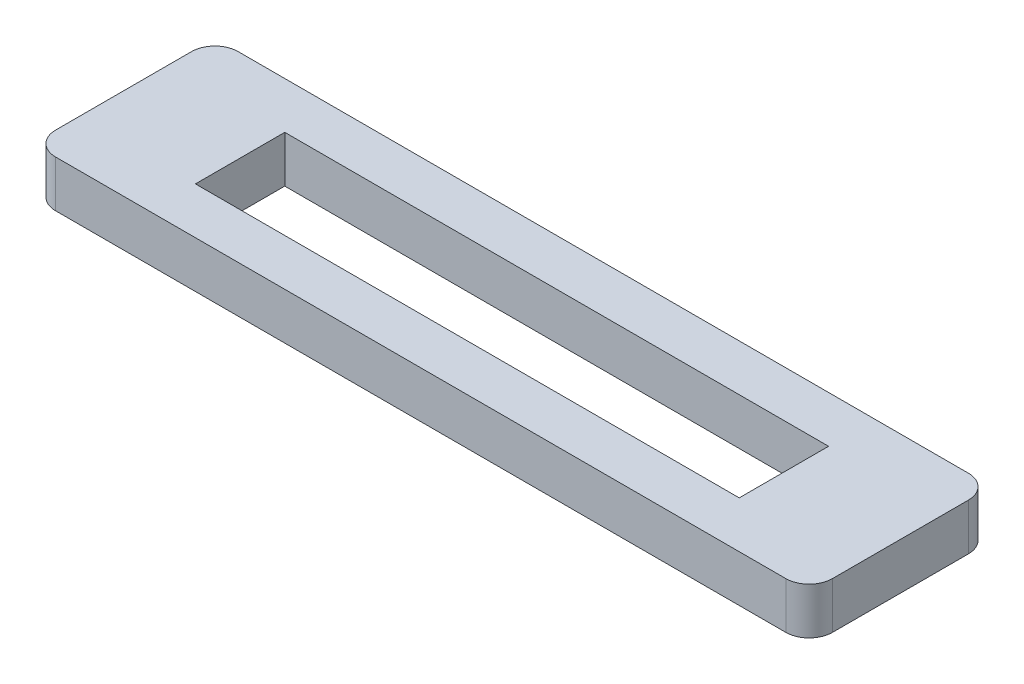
ISO-10303-21;
HEADER;
FILE_DESCRIPTION(('STEP AP214'),'2;1');
FILE_NAME('part.step','',(''),(''),'','','');
FILE_SCHEMA(('AUTOMOTIVE_DESIGN { 1 0 10303 214 1 1 1 1 }'));
ENDSEC;
DATA;
#1=APPLICATION_CONTEXT('core data for automotive mechanical design processes');
#2=APPLICATION_PROTOCOL_DEFINITION('international standard','automotive_design',2000,#1);
#3=PRODUCT_CONTEXT('',#1,'mechanical');
#4=PRODUCT('Part','Part','',(#3));
#5=PRODUCT_RELATED_PRODUCT_CATEGORY('part','',(#4));
#6=PRODUCT_DEFINITION_FORMATION('','',#4);
#7=PRODUCT_DEFINITION_CONTEXT('part definition',#1,'design');
#8=PRODUCT_DEFINITION('design','',#6,#7);
#9=PRODUCT_DEFINITION_SHAPE('','',#8);
#10=(LENGTH_UNIT() NAMED_UNIT(*) SI_UNIT(.MILLI.,.METRE.));
#11=(NAMED_UNIT(*) PLANE_ANGLE_UNIT() SI_UNIT($,.RADIAN.));
#12=(NAMED_UNIT(*) SI_UNIT($,.STERADIAN.) SOLID_ANGLE_UNIT());
#13=UNCERTAINTY_MEASURE_WITH_UNIT(LENGTH_MEASURE(1.E-05),#10,'distance_accuracy_value','');
#14=(GEOMETRIC_REPRESENTATION_CONTEXT(3) GLOBAL_UNCERTAINTY_ASSIGNED_CONTEXT((#13)) GLOBAL_UNIT_ASSIGNED_CONTEXT((#10,
#11,#12)) REPRESENTATION_CONTEXT('',''));
#15=CARTESIAN_POINT('',(0.,0.,0.));
#16=DIRECTION('',(0.,0.,1.));
#17=DIRECTION('',(1.,0.,0.));
#18=AXIS2_PLACEMENT_3D('',#15,#16,#17);
#19=CARTESIAN_POINT('',(0.,6.,0.));
#20=DIRECTION('',(0.,1.,0.));
#21=DIRECTION('',(0.,0.,1.));
#22=AXIS2_PLACEMENT_3D('',#19,#20,#21);
#23=PLANE('',#22);
#24=DIRECTION('',(0.,0.,-1.));
#25=VECTOR('',#24,1.);
#26=CARTESIAN_POINT('',(50.,6.,-11.75));
#27=LINE('',#26,#25);
#28=CARTESIAN_POINT('',(50.,6.,8.75));
#29=VERTEX_POINT('',#28);
#30=CARTESIAN_POINT('',(50.,6.,-8.75));
#31=VERTEX_POINT('',#30);
#32=EDGE_CURVE('E189',#29,#31,#27,.T.);
#33=ORIENTED_EDGE('',*,*,#32,.T.);
#34=CARTESIAN_POINT('',(47.,6.,-8.75));
#35=DIRECTION('',(0.,1.,0.));
#36=DIRECTION('',(0.,0.,1.));
#37=AXIS2_PLACEMENT_3D('',#34,#35,#36);
#38=CIRCLE('',#37,3.);
#39=CARTESIAN_POINT('',(47.,6.,-11.75));
#40=VERTEX_POINT('',#39);
#41=EDGE_CURVE('E251',#31,#40,#38,.T.);
#42=ORIENTED_EDGE('',*,*,#41,.T.);
#43=DIRECTION('',(-1.,0.,0.));
#44=VECTOR('',#43,1.);
#45=CARTESIAN_POINT('',(-50.,6.,-11.75));
#46=LINE('',#45,#44);
#47=CARTESIAN_POINT('',(-47.,6.,-11.75));
#48=VERTEX_POINT('',#47);
#49=EDGE_CURVE('E193',#40,#48,#46,.T.);
#50=ORIENTED_EDGE('',*,*,#49,.T.);
#51=CARTESIAN_POINT('',(-47.,6.,-8.75));
#52=DIRECTION('',(0.,1.,0.));
#53=DIRECTION('',(0.,0.,1.));
#54=AXIS2_PLACEMENT_3D('',#51,#52,#53);
#55=CIRCLE('',#54,3.);
#56=CARTESIAN_POINT('',(-50.,6.,-8.75));
#57=VERTEX_POINT('',#56);
#58=EDGE_CURVE('E245',#48,#57,#55,.T.);
#59=ORIENTED_EDGE('',*,*,#58,.T.);
#60=DIRECTION('',(0.,0.,1.));
#61=VECTOR('',#60,1.);
#62=CARTESIAN_POINT('',(-50.,6.,-11.75));
#63=LINE('',#62,#61);
#64=CARTESIAN_POINT('',(-50.,6.,8.75));
#65=VERTEX_POINT('',#64);
#66=EDGE_CURVE('E198',#57,#65,#63,.T.);
#67=ORIENTED_EDGE('',*,*,#66,.T.);
#68=CARTESIAN_POINT('',(-47.,6.,8.75));
#69=DIRECTION('',(0.,1.,0.));
#70=DIRECTION('',(0.,0.,1.));
#71=AXIS2_PLACEMENT_3D('',#68,#69,#70);
#72=CIRCLE('',#71,3.);
#73=CARTESIAN_POINT('',(-47.,6.,11.75));
#74=VERTEX_POINT('',#73);
#75=EDGE_CURVE('E66',#65,#74,#72,.T.);
#76=ORIENTED_EDGE('',*,*,#75,.T.);
#77=DIRECTION('',(1.,0.,0.));
#78=VECTOR('',#77,1.);
#79=CARTESIAN_POINT('',(-50.,6.,11.75));
#80=LINE('',#79,#78);
#81=CARTESIAN_POINT('',(47.,6.,11.75));
#82=VERTEX_POINT('',#81);
#83=EDGE_CURVE('E201',#74,#82,#80,.T.);
#84=ORIENTED_EDGE('',*,*,#83,.T.);
#85=CARTESIAN_POINT('',(47.,6.,8.75));
#86=DIRECTION('',(0.,1.,0.));
#87=DIRECTION('',(0.,0.,1.));
#88=AXIS2_PLACEMENT_3D('',#85,#86,#87);
#89=CIRCLE('',#88,3.);
#90=EDGE_CURVE('E248',#82,#29,#89,.T.);
#91=ORIENTED_EDGE('',*,*,#90,.T.);
#92=EDGE_LOOP('',(#33,#42,#50,#59,#67,#76,#84,#91));
#93=FACE_BOUND('',#92,.T.);
#94=DIRECTION('',(-1.,0.,0.));
#95=VECTOR('',#94,1.);
#96=CARTESIAN_POINT('',(-35.,6.,-5.75));
#97=LINE('',#96,#95);
#98=CARTESIAN_POINT('',(35.,6.,-5.75));
#99=VERTEX_POINT('',#98);
#100=CARTESIAN_POINT('',(-35.,6.,-5.75));
#101=VERTEX_POINT('',#100);
#102=EDGE_CURVE('E147',#99,#101,#97,.T.);
#103=ORIENTED_EDGE('',*,*,#102,.F.);
#104=DIRECTION('',(0.,0.,-1.));
#105=VECTOR('',#104,1.);
#106=CARTESIAN_POINT('',(35.,6.,-5.75));
#107=LINE('',#106,#105);
#108=CARTESIAN_POINT('',(35.,6.,5.75));
#109=VERTEX_POINT('',#108);
#110=EDGE_CURVE('E136',#109,#99,#107,.T.);
#111=ORIENTED_EDGE('',*,*,#110,.F.);
#112=DIRECTION('',(1.,0.,0.));
#113=VECTOR('',#112,1.);
#114=CARTESIAN_POINT('',(-35.,6.,5.75));
#115=LINE('',#114,#113);
#116=CARTESIAN_POINT('',(-35.,6.,5.75));
#117=VERTEX_POINT('',#116);
#118=EDGE_CURVE('E165',#117,#109,#115,.T.);
#119=ORIENTED_EDGE('',*,*,#118,.F.);
#120=DIRECTION('',(0.,0.,1.));
#121=VECTOR('',#120,1.);
#122=CARTESIAN_POINT('',(-35.,6.,-5.75));
#123=LINE('',#122,#121);
#124=EDGE_CURVE('E161',#101,#117,#123,.T.);
#125=ORIENTED_EDGE('',*,*,#124,.F.);
#126=EDGE_LOOP('',(#103,#111,#119,#125));
#127=FACE_BOUND('',#126,.T.);
#128=ADVANCED_FACE('F43',(#93,#127),#23,.T.);
#129=CARTESIAN_POINT('',(0.,0.,0.));
#130=DIRECTION('',(0.,1.,0.));
#131=DIRECTION('',(0.,0.,1.));
#132=AXIS2_PLACEMENT_3D('',#129,#130,#131);
#133=PLANE('',#132);
#134=DIRECTION('',(-1.,0.,0.));
#135=VECTOR('',#134,1.);
#136=CARTESIAN_POINT('',(-50.,0.,-11.75));
#137=LINE('',#136,#135);
#138=CARTESIAN_POINT('',(47.,0.,-11.75));
#139=VERTEX_POINT('',#138);
#140=CARTESIAN_POINT('',(-47.,0.,-11.75));
#141=VERTEX_POINT('',#140);
#142=EDGE_CURVE('E208',#139,#141,#137,.T.);
#143=ORIENTED_EDGE('',*,*,#142,.F.);
#144=CARTESIAN_POINT('',(47.,0.,-8.75));
#145=DIRECTION('',(0.,1.,0.));
#146=DIRECTION('',(0.,0.,1.));
#147=AXIS2_PLACEMENT_3D('',#144,#145,#146);
#148=CIRCLE('',#147,3.);
#149=CARTESIAN_POINT('',(50.,0.,-8.75));
#150=VERTEX_POINT('',#149);
#151=EDGE_CURVE('E233',#139,#150,#148,.F.);
#152=ORIENTED_EDGE('',*,*,#151,.T.);
#153=DIRECTION('',(0.,0.,-1.));
#154=VECTOR('',#153,1.);
#155=CARTESIAN_POINT('',(50.,0.,-11.75));
#156=LINE('',#155,#154);
#157=CARTESIAN_POINT('',(50.,0.,8.75));
#158=VERTEX_POINT('',#157);
#159=EDGE_CURVE('E156',#158,#150,#156,.T.);
#160=ORIENTED_EDGE('',*,*,#159,.F.);
#161=CARTESIAN_POINT('',(47.,0.,8.75));
#162=DIRECTION('',(0.,1.,0.));
#163=DIRECTION('',(0.,0.,1.));
#164=AXIS2_PLACEMENT_3D('',#161,#162,#163);
#165=CIRCLE('',#164,3.);
#166=CARTESIAN_POINT('',(47.,0.,11.75));
#167=VERTEX_POINT('',#166);
#168=EDGE_CURVE('E230',#158,#167,#165,.F.);
#169=ORIENTED_EDGE('',*,*,#168,.T.);
#170=DIRECTION('',(1.,0.,0.));
#171=VECTOR('',#170,1.);
#172=CARTESIAN_POINT('',(-50.,0.,11.75));
#173=LINE('',#172,#171);
#174=CARTESIAN_POINT('',(-47.,0.,11.75));
#175=VERTEX_POINT('',#174);
#176=EDGE_CURVE('E194',#175,#167,#173,.T.);
#177=ORIENTED_EDGE('',*,*,#176,.F.);
#178=CARTESIAN_POINT('',(-47.,0.,8.75));
#179=DIRECTION('',(0.,1.,0.));
#180=DIRECTION('',(0.,0.,1.));
#181=AXIS2_PLACEMENT_3D('',#178,#179,#180);
#182=CIRCLE('',#181,3.);
#183=CARTESIAN_POINT('',(-50.,0.,8.75));
#184=VERTEX_POINT('',#183);
#185=EDGE_CURVE('E224',#175,#184,#182,.F.);
#186=ORIENTED_EDGE('',*,*,#185,.T.);
#187=DIRECTION('',(0.,0.,1.));
#188=VECTOR('',#187,1.);
#189=CARTESIAN_POINT('',(-50.,0.,-11.75));
#190=LINE('',#189,#188);
#191=CARTESIAN_POINT('',(-50.,0.,-8.75));
#192=VERTEX_POINT('',#191);
#193=EDGE_CURVE('E212',#192,#184,#190,.T.);
#194=ORIENTED_EDGE('',*,*,#193,.F.);
#195=CARTESIAN_POINT('',(-47.,0.,-8.75));
#196=DIRECTION('',(0.,1.,0.));
#197=DIRECTION('',(0.,0.,1.));
#198=AXIS2_PLACEMENT_3D('',#195,#196,#197);
#199=CIRCLE('',#198,3.);
#200=EDGE_CURVE('E227',#192,#141,#199,.F.);
#201=ORIENTED_EDGE('',*,*,#200,.T.);
#202=EDGE_LOOP('',(#143,#152,#160,#169,#177,#186,#194,#201));
#203=FACE_BOUND('',#202,.T.);
#204=DIRECTION('',(0.,0.,-1.));
#205=VECTOR('',#204,1.);
#206=CARTESIAN_POINT('',(35.,0.,-5.75));
#207=LINE('',#206,#205);
#208=CARTESIAN_POINT('',(35.,0.,5.75));
#209=VERTEX_POINT('',#208);
#210=CARTESIAN_POINT('',(35.,0.,-5.75));
#211=VERTEX_POINT('',#210);
#212=EDGE_CURVE('E170',#209,#211,#207,.T.);
#213=ORIENTED_EDGE('',*,*,#212,.T.);
#214=DIRECTION('',(-1.,0.,0.));
#215=VECTOR('',#214,1.);
#216=CARTESIAN_POINT('',(-35.,0.,-5.75));
#217=LINE('',#216,#215);
#218=CARTESIAN_POINT('',(-35.,0.,-5.75));
#219=VERTEX_POINT('',#218);
#220=EDGE_CURVE('E154',#211,#219,#217,.T.);
#221=ORIENTED_EDGE('',*,*,#220,.T.);
#222=DIRECTION('',(0.,0.,1.));
#223=VECTOR('',#222,1.);
#224=CARTESIAN_POINT('',(-35.,0.,-5.75));
#225=LINE('',#224,#223);
#226=CARTESIAN_POINT('',(-35.,0.,5.75));
#227=VERTEX_POINT('',#226);
#228=EDGE_CURVE('E175',#219,#227,#225,.T.);
#229=ORIENTED_EDGE('',*,*,#228,.T.);
#230=DIRECTION('',(1.,0.,0.));
#231=VECTOR('',#230,1.);
#232=CARTESIAN_POINT('',(-35.,0.,5.75));
#233=LINE('',#232,#231);
#234=EDGE_CURVE('E148',#227,#209,#233,.T.);
#235=ORIENTED_EDGE('',*,*,#234,.T.);
#236=EDGE_LOOP('',(#213,#221,#229,#235));
#237=FACE_BOUND('',#236,.T.);
#238=ADVANCED_FACE('F273',(#203,#237),#133,.F.);
#239=CARTESIAN_POINT('',(50.,6.,-11.75));
#240=DIRECTION('',(-1.,0.,0.));
#241=DIRECTION('',(0.,0.,1.));
#242=AXIS2_PLACEMENT_3D('',#239,#240,#241);
#243=PLANE('',#242);
#244=ORIENTED_EDGE('',*,*,#159,.T.);
#245=DIRECTION('',(0.,-1.,0.));
#246=VECTOR('',#245,1.);
#247=CARTESIAN_POINT('',(50.,6.,-8.75));
#248=LINE('',#247,#246);
#249=EDGE_CURVE('E240',#150,#31,#248,.F.);
#250=ORIENTED_EDGE('',*,*,#249,.T.);
#251=ORIENTED_EDGE('',*,*,#32,.F.);
#252=DIRECTION('',(0.,-1.,0.));
#253=VECTOR('',#252,1.);
#254=CARTESIAN_POINT('',(50.,6.,8.75));
#255=LINE('',#254,#253);
#256=EDGE_CURVE('E236',#29,#158,#255,.T.);
#257=ORIENTED_EDGE('',*,*,#256,.T.);
#258=EDGE_LOOP('',(#244,#250,#251,#257));
#259=FACE_BOUND('',#258,.T.);
#260=ADVANCED_FACE('F282',(#259),#243,.F.);
#261=CARTESIAN_POINT('',(-50.,6.,-11.75));
#262=DIRECTION('',(0.,0.,1.));
#263=DIRECTION('',(1.,0.,0.));
#264=AXIS2_PLACEMENT_3D('',#261,#262,#263);
#265=PLANE('',#264);
#266=ORIENTED_EDGE('',*,*,#49,.F.);
#267=DIRECTION('',(0.,-1.,0.));
#268=VECTOR('',#267,1.);
#269=CARTESIAN_POINT('',(47.,6.,-11.75));
#270=LINE('',#269,#268);
#271=EDGE_CURVE('E220',#40,#139,#270,.T.);
#272=ORIENTED_EDGE('',*,*,#271,.T.);
#273=ORIENTED_EDGE('',*,*,#142,.T.);
#274=DIRECTION('',(0.,-1.,0.));
#275=VECTOR('',#274,1.);
#276=CARTESIAN_POINT('',(-47.,6.,-11.75));
#277=LINE('',#276,#275);
#278=EDGE_CURVE('E204',#141,#48,#277,.F.);
#279=ORIENTED_EDGE('',*,*,#278,.T.);
#280=EDGE_LOOP('',(#266,#272,#273,#279));
#281=FACE_BOUND('',#280,.T.);
#282=ADVANCED_FACE('F290',(#281),#265,.F.);
#283=CARTESIAN_POINT('',(-50.,6.,-11.75));
#284=DIRECTION('',(1.,0.,0.));
#285=DIRECTION('',(0.,0.,-1.));
#286=AXIS2_PLACEMENT_3D('',#283,#284,#285);
#287=PLANE('',#286);
#288=ORIENTED_EDGE('',*,*,#66,.F.);
#289=DIRECTION('',(0.,-1.,0.));
#290=VECTOR('',#289,1.);
#291=CARTESIAN_POINT('',(-50.,6.,-8.75));
#292=LINE('',#291,#290);
#293=EDGE_CURVE('E11',#57,#192,#292,.T.);
#294=ORIENTED_EDGE('',*,*,#293,.T.);
#295=ORIENTED_EDGE('',*,*,#193,.T.);
#296=DIRECTION('',(0.,-1.,0.));
#297=VECTOR('',#296,1.);
#298=CARTESIAN_POINT('',(-50.,6.,8.75));
#299=LINE('',#298,#297);
#300=EDGE_CURVE('E52',#184,#65,#299,.F.);
#301=ORIENTED_EDGE('',*,*,#300,.T.);
#302=EDGE_LOOP('',(#288,#294,#295,#301));
#303=FACE_BOUND('',#302,.T.);
#304=ADVANCED_FACE('F263',(#303),#287,.F.);
#305=CARTESIAN_POINT('',(-50.,6.,11.75));
#306=DIRECTION('',(0.,0.,-1.));
#307=DIRECTION('',(-1.,0.,0.));
#308=AXIS2_PLACEMENT_3D('',#305,#306,#307);
#309=PLANE('',#308);
#310=ORIENTED_EDGE('',*,*,#176,.T.);
#311=DIRECTION('',(0.,-1.,0.));
#312=VECTOR('',#311,1.);
#313=CARTESIAN_POINT('',(47.,6.,11.75));
#314=LINE('',#313,#312);
#315=EDGE_CURVE('E59',#167,#82,#314,.F.);
#316=ORIENTED_EDGE('',*,*,#315,.T.);
#317=ORIENTED_EDGE('',*,*,#83,.F.);
#318=DIRECTION('',(0.,-1.,0.));
#319=VECTOR('',#318,1.);
#320=CARTESIAN_POINT('',(-47.,6.,11.75));
#321=LINE('',#320,#319);
#322=EDGE_CURVE('E254',#74,#175,#321,.T.);
#323=ORIENTED_EDGE('',*,*,#322,.T.);
#324=EDGE_LOOP('',(#310,#316,#317,#323));
#325=FACE_BOUND('',#324,.T.);
#326=ADVANCED_FACE('F270',(#325),#309,.F.);
#327=CARTESIAN_POINT('',(35.,6.,-5.75));
#328=DIRECTION('',(-1.,0.,0.));
#329=DIRECTION('',(0.,0.,1.));
#330=AXIS2_PLACEMENT_3D('',#327,#328,#329);
#331=PLANE('',#330);
#332=ORIENTED_EDGE('',*,*,#212,.F.);
#333=DIRECTION('',(0.,-1.,0.));
#334=VECTOR('',#333,1.);
#335=CARTESIAN_POINT('',(35.,6.,5.75));
#336=LINE('',#335,#334);
#337=EDGE_CURVE('E142',#109,#209,#336,.T.);
#338=ORIENTED_EDGE('',*,*,#337,.F.);
#339=ORIENTED_EDGE('',*,*,#110,.T.);
#340=DIRECTION('',(0.,-1.,0.));
#341=VECTOR('',#340,1.);
#342=CARTESIAN_POINT('',(35.,6.,-5.75));
#343=LINE('',#342,#341);
#344=EDGE_CURVE('E139',#99,#211,#343,.T.);
#345=ORIENTED_EDGE('',*,*,#344,.T.);
#346=EDGE_LOOP('',(#332,#338,#339,#345));
#347=FACE_BOUND('',#346,.T.);
#348=ADVANCED_FACE('F138',(#347),#331,.T.);
#349=CARTESIAN_POINT('',(-35.,6.,-5.75));
#350=DIRECTION('',(0.,0.,1.));
#351=DIRECTION('',(1.,0.,0.));
#352=AXIS2_PLACEMENT_3D('',#349,#350,#351);
#353=PLANE('',#352);
#354=ORIENTED_EDGE('',*,*,#220,.F.);
#355=ORIENTED_EDGE('',*,*,#344,.F.);
#356=ORIENTED_EDGE('',*,*,#102,.T.);
#357=DIRECTION('',(0.,-1.,0.));
#358=VECTOR('',#357,1.);
#359=CARTESIAN_POINT('',(-35.,6.,-5.75));
#360=LINE('',#359,#358);
#361=EDGE_CURVE('E157',#101,#219,#360,.T.);
#362=ORIENTED_EDGE('',*,*,#361,.T.);
#363=EDGE_LOOP('',(#354,#355,#356,#362));
#364=FACE_BOUND('',#363,.T.);
#365=ADVANCED_FACE('F151',(#364),#353,.T.);
#366=CARTESIAN_POINT('',(-35.,6.,-5.75));
#367=DIRECTION('',(1.,0.,0.));
#368=DIRECTION('',(0.,0.,-1.));
#369=AXIS2_PLACEMENT_3D('',#366,#367,#368);
#370=PLANE('',#369);
#371=ORIENTED_EDGE('',*,*,#228,.F.);
#372=ORIENTED_EDGE('',*,*,#361,.F.);
#373=ORIENTED_EDGE('',*,*,#124,.T.);
#374=DIRECTION('',(0.,-1.,0.));
#375=VECTOR('',#374,1.);
#376=CARTESIAN_POINT('',(-35.,6.,5.75));
#377=LINE('',#376,#375);
#378=EDGE_CURVE('E184',#117,#227,#377,.T.);
#379=ORIENTED_EDGE('',*,*,#378,.T.);
#380=EDGE_LOOP('',(#371,#372,#373,#379));
#381=FACE_BOUND('',#380,.T.);
#382=ADVANCED_FACE('F322',(#381),#370,.T.);
#383=CARTESIAN_POINT('',(-35.,6.,5.75));
#384=DIRECTION('',(0.,0.,-1.));
#385=DIRECTION('',(-1.,0.,0.));
#386=AXIS2_PLACEMENT_3D('',#383,#384,#385);
#387=PLANE('',#386);
#388=ORIENTED_EDGE('',*,*,#234,.F.);
#389=ORIENTED_EDGE('',*,*,#378,.F.);
#390=ORIENTED_EDGE('',*,*,#118,.T.);
#391=ORIENTED_EDGE('',*,*,#337,.T.);
#392=EDGE_LOOP('',(#388,#389,#390,#391));
#393=FACE_BOUND('',#392,.T.);
#394=ADVANCED_FACE('F318',(#393),#387,.T.);
#395=CARTESIAN_POINT('',(47.,6.,-8.75));
#396=DIRECTION('',(0.,-1.,0.));
#397=DIRECTION('',(0.,0.,-1.));
#398=AXIS2_PLACEMENT_3D('',#395,#396,#397);
#399=CYLINDRICAL_SURFACE('',#398,3.);
#400=ORIENTED_EDGE('',*,*,#41,.F.);
#401=ORIENTED_EDGE('',*,*,#249,.F.);
#402=ORIENTED_EDGE('',*,*,#151,.F.);
#403=ORIENTED_EDGE('',*,*,#271,.F.);
#404=EDGE_LOOP('',(#400,#401,#402,#403));
#405=FACE_BOUND('',#404,.T.);
#406=ADVANCED_FACE('F288',(#405),#399,.T.);
#407=CARTESIAN_POINT('',(47.,6.,8.75));
#408=DIRECTION('',(0.,-1.,0.));
#409=DIRECTION('',(0.,0.,-1.));
#410=AXIS2_PLACEMENT_3D('',#407,#408,#409);
#411=CYLINDRICAL_SURFACE('',#410,3.);
#412=ORIENTED_EDGE('',*,*,#90,.F.);
#413=ORIENTED_EDGE('',*,*,#315,.F.);
#414=ORIENTED_EDGE('',*,*,#168,.F.);
#415=ORIENTED_EDGE('',*,*,#256,.F.);
#416=EDGE_LOOP('',(#412,#413,#414,#415));
#417=FACE_BOUND('',#416,.T.);
#418=ADVANCED_FACE('F279',(#417),#411,.T.);
#419=CARTESIAN_POINT('',(-47.,6.,-8.75));
#420=DIRECTION('',(0.,-1.,0.));
#421=DIRECTION('',(0.,0.,-1.));
#422=AXIS2_PLACEMENT_3D('',#419,#420,#421);
#423=CYLINDRICAL_SURFACE('',#422,3.);
#424=ORIENTED_EDGE('',*,*,#58,.F.);
#425=ORIENTED_EDGE('',*,*,#278,.F.);
#426=ORIENTED_EDGE('',*,*,#200,.F.);
#427=ORIENTED_EDGE('',*,*,#293,.F.);
#428=EDGE_LOOP('',(#424,#425,#426,#427));
#429=FACE_BOUND('',#428,.T.);
#430=ADVANCED_FACE('F293',(#429),#423,.T.);
#431=CARTESIAN_POINT('',(-47.,6.,8.75));
#432=DIRECTION('',(0.,-1.,0.));
#433=DIRECTION('',(0.,0.,-1.));
#434=AXIS2_PLACEMENT_3D('',#431,#432,#433);
#435=CYLINDRICAL_SURFACE('',#434,3.);
#436=ORIENTED_EDGE('',*,*,#75,.F.);
#437=ORIENTED_EDGE('',*,*,#300,.F.);
#438=ORIENTED_EDGE('',*,*,#185,.F.);
#439=ORIENTED_EDGE('',*,*,#322,.F.);
#440=EDGE_LOOP('',(#436,#437,#438,#439));
#441=FACE_BOUND('',#440,.T.);
#442=ADVANCED_FACE('F45',(#441),#435,.T.);
#443=CLOSED_SHELL('',(#128,#238,#260,#282,#304,#326,#348,#365,#382,#394,#406,#418,#430,#442));
#444=MANIFOLD_SOLID_BREP('B2',#443);
#445=ADVANCED_BREP_SHAPE_REPRESENTATION('',(#18,#444),#14);
#446=SHAPE_DEFINITION_REPRESENTATION(#9,#445);
ENDSEC;
END-ISO-10303-21;
